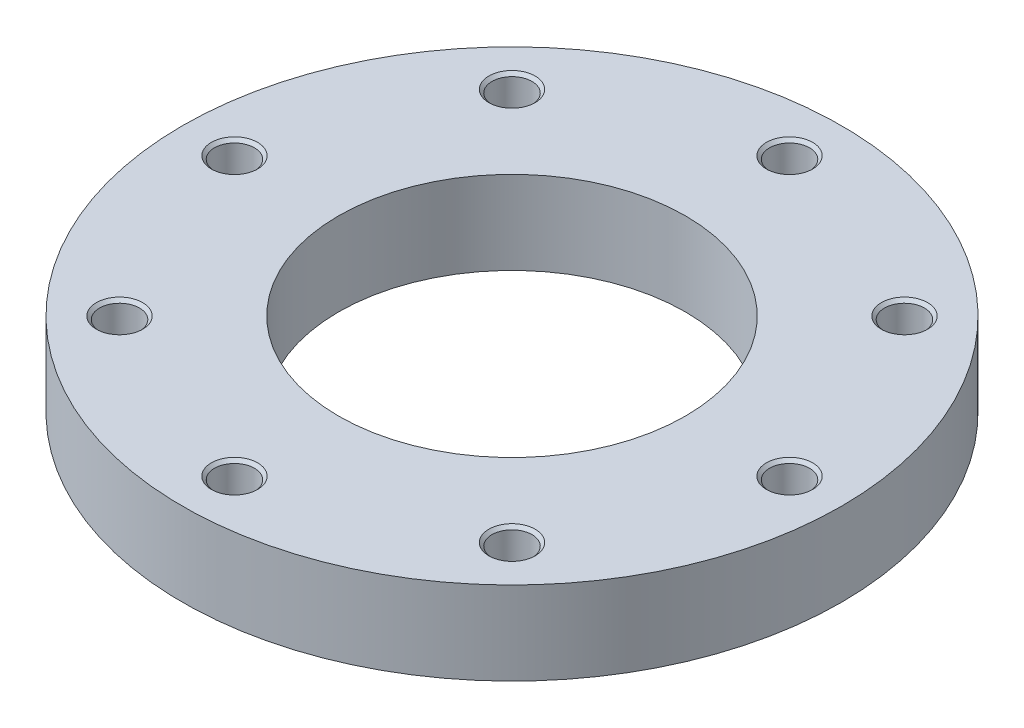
ISO-10303-21;
HEADER;
FILE_DESCRIPTION(('STEP AP214'),'2;1');
FILE_NAME('part.step','',(''),(''),'','','');
FILE_SCHEMA(('AUTOMOTIVE_DESIGN { 1 0 10303 214 1 1 1 1 }'));
ENDSEC;
DATA;
#1=APPLICATION_CONTEXT('core data for automotive mechanical design processes');
#2=APPLICATION_PROTOCOL_DEFINITION('international standard','automotive_design',2000,#1);
#3=PRODUCT_CONTEXT('',#1,'mechanical');
#4=PRODUCT('Part','Part','',(#3));
#5=PRODUCT_RELATED_PRODUCT_CATEGORY('part','',(#4));
#6=PRODUCT_DEFINITION_FORMATION('','',#4);
#7=PRODUCT_DEFINITION_CONTEXT('part definition',#1,'design');
#8=PRODUCT_DEFINITION('design','',#6,#7);
#9=PRODUCT_DEFINITION_SHAPE('','',#8);
#10=(LENGTH_UNIT() NAMED_UNIT(*) SI_UNIT(.MILLI.,.METRE.));
#11=(NAMED_UNIT(*) PLANE_ANGLE_UNIT() SI_UNIT($,.RADIAN.));
#12=(NAMED_UNIT(*) SI_UNIT($,.STERADIAN.) SOLID_ANGLE_UNIT());
#13=UNCERTAINTY_MEASURE_WITH_UNIT(LENGTH_MEASURE(1.E-05),#10,'distance_accuracy_value','');
#14=(GEOMETRIC_REPRESENTATION_CONTEXT(3) GLOBAL_UNCERTAINTY_ASSIGNED_CONTEXT((#13)) GLOBAL_UNIT_ASSIGNED_CONTEXT((#10,
#11,#12)) REPRESENTATION_CONTEXT('',''));
#15=CARTESIAN_POINT('',(0.,0.,0.));
#16=DIRECTION('',(0.,0.,1.));
#17=DIRECTION('',(1.,0.,0.));
#18=AXIS2_PLACEMENT_3D('',#15,#16,#17);
#19=CARTESIAN_POINT('',(0.,18.,0.));
#20=DIRECTION('',(0.,-1.,0.));
#21=DIRECTION('',(1.,0.,0.));
#22=AXIS2_PLACEMENT_3D('',#19,#20,#21);
#23=CYLINDRICAL_SURFACE('',#22,142.5);
#24=CARTESIAN_POINT('',(0.,0.,0.));
#25=DIRECTION('',(0.,1.,0.));
#26=DIRECTION('',(1.,0.,0.));
#27=AXIS2_PLACEMENT_3D('',#24,#25,#26);
#28=CIRCLE('',#27,142.5);
#29=CARTESIAN_POINT('',(142.5,0.,0.));
#30=VERTEX_POINT('',#29);
#31=EDGE_CURVE('E9',#30,#30,#28,.T.);
#32=ORIENTED_EDGE('',*,*,#31,.T.);
#33=EDGE_LOOP('',(#32));
#34=FACE_BOUND('',#33,.T.);
#35=CARTESIAN_POINT('',(0.,36.,0.));
#36=DIRECTION('',(0.,1.,0.));
#37=DIRECTION('',(1.,0.,0.));
#38=AXIS2_PLACEMENT_3D('',#35,#36,#37);
#39=CIRCLE('',#38,142.5);
#40=CARTESIAN_POINT('',(142.5,36.,0.));
#41=VERTEX_POINT('',#40);
#42=EDGE_CURVE('E198',#41,#41,#39,.T.);
#43=ORIENTED_EDGE('',*,*,#42,.F.);
#44=EDGE_LOOP('',(#43));
#45=FACE_BOUND('',#44,.T.);
#46=ADVANCED_FACE('F15',(#34,#45),#23,.T.);
#47=CARTESIAN_POINT('',(108.75,0.,0.));
#48=DIRECTION('',(0.,-1.,0.));
#49=DIRECTION('',(-1.,0.,0.));
#50=AXIS2_PLACEMENT_3D('',#47,#48,#49);
#51=PLANE('',#50);
#52=CARTESIAN_POINT('',(0.,0.,0.));
#53=DIRECTION('',(0.,1.,0.));
#54=DIRECTION('',(1.,0.,0.));
#55=AXIS2_PLACEMENT_3D('',#52,#53,#54);
#56=CIRCLE('',#55,75.);
#57=CARTESIAN_POINT('',(75.,0.,0.));
#58=VERTEX_POINT('',#57);
#59=EDGE_CURVE('E18',#58,#58,#56,.T.);
#60=ORIENTED_EDGE('',*,*,#59,.T.);
#61=EDGE_LOOP('',(#60));
#62=FACE_BOUND('',#61,.T.);
#63=ORIENTED_EDGE('',*,*,#31,.F.);
#64=EDGE_LOOP('',(#63));
#65=FACE_BOUND('',#64,.T.);
#66=ADVANCED_FACE('F353',(#62,#65),#51,.T.);
#67=CARTESIAN_POINT('',(0.,18.,0.));
#68=DIRECTION('',(0.,-1.,0.));
#69=DIRECTION('',(1.,0.,0.));
#70=AXIS2_PLACEMENT_3D('',#67,#68,#69);
#71=CYLINDRICAL_SURFACE('',#70,75.);
#72=CARTESIAN_POINT('',(0.,36.,0.));
#73=DIRECTION('',(0.,1.,0.));
#74=DIRECTION('',(1.,0.,0.));
#75=AXIS2_PLACEMENT_3D('',#72,#73,#74);
#76=CIRCLE('',#75,75.);
#77=CARTESIAN_POINT('',(75.,36.,0.));
#78=VERTEX_POINT('',#77);
#79=EDGE_CURVE('E194',#78,#78,#76,.T.);
#80=ORIENTED_EDGE('',*,*,#79,.T.);
#81=EDGE_LOOP('',(#80));
#82=FACE_BOUND('',#81,.T.);
#83=ORIENTED_EDGE('',*,*,#59,.F.);
#84=EDGE_LOOP('',(#83));
#85=FACE_BOUND('',#84,.T.);
#86=ADVANCED_FACE('F195',(#82,#85),#71,.F.);
#87=CARTESIAN_POINT('',(108.75,36.,0.));
#88=DIRECTION('',(0.,1.,0.));
#89=DIRECTION('',(1.,0.,0.));
#90=AXIS2_PLACEMENT_3D('',#87,#88,#89);
#91=PLANE('',#90);
#92=ORIENTED_EDGE('',*,*,#42,.T.);
#93=EDGE_LOOP('',(#92));
#94=FACE_BOUND('',#93,.T.);
#95=ORIENTED_EDGE('',*,*,#79,.F.);
#96=EDGE_LOOP('',(#95));
#97=FACE_BOUND('',#96,.T.);
#98=CARTESIAN_POINT('',(120.,36.,0.));
#99=DIRECTION('',(0.,-1.,0.));
#100=DIRECTION('',(1.,0.,0.));
#101=AXIS2_PLACEMENT_3D('',#98,#99,#100);
#102=CIRCLE('',#101,10.);
#103=CARTESIAN_POINT('',(130.,36.,0.));
#104=VERTEX_POINT('',#103);
#105=EDGE_CURVE('E208',#104,#104,#102,.T.);
#106=ORIENTED_EDGE('',*,*,#105,.T.);
#107=EDGE_LOOP('',(#106));
#108=FACE_BOUND('',#107,.T.);
#109=CARTESIAN_POINT('',(84.8528137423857,36.,-84.8528137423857));
#110=DIRECTION('',(0.,-1.,0.));
#111=DIRECTION('',(0.707106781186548,0.,-0.707106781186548));
#112=AXIS2_PLACEMENT_3D('',#109,#110,#111);
#113=CIRCLE('',#112,10.);
#114=CARTESIAN_POINT('',(91.9238815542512,36.,-91.9238815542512));
#115=VERTEX_POINT('',#114);
#116=EDGE_CURVE('E220',#115,#115,#113,.T.);
#117=ORIENTED_EDGE('',*,*,#116,.T.);
#118=EDGE_LOOP('',(#117));
#119=FACE_BOUND('',#118,.T.);
#120=CARTESIAN_POINT('',(0.,36.,-120.));
#121=DIRECTION('',(0.,-1.,0.));
#122=DIRECTION('',(0.,0.,-1.));
#123=AXIS2_PLACEMENT_3D('',#120,#121,#122);
#124=CIRCLE('',#123,10.);
#125=CARTESIAN_POINT('',(0.,36.,-130.));
#126=VERTEX_POINT('',#125);
#127=EDGE_CURVE('E232',#126,#126,#124,.T.);
#128=ORIENTED_EDGE('',*,*,#127,.T.);
#129=EDGE_LOOP('',(#128));
#130=FACE_BOUND('',#129,.T.);
#131=CARTESIAN_POINT('',(-84.8528137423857,36.,-84.8528137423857));
#132=DIRECTION('',(0.,-1.,0.));
#133=DIRECTION('',(-0.707106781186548,0.,-0.707106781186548));
#134=AXIS2_PLACEMENT_3D('',#131,#132,#133);
#135=CIRCLE('',#134,10.);
#136=CARTESIAN_POINT('',(-91.9238815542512,36.,-91.9238815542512));
#137=VERTEX_POINT('',#136);
#138=EDGE_CURVE('E244',#137,#137,#135,.T.);
#139=ORIENTED_EDGE('',*,*,#138,.T.);
#140=EDGE_LOOP('',(#139));
#141=FACE_BOUND('',#140,.T.);
#142=CARTESIAN_POINT('',(-120.,36.,0.));
#143=DIRECTION('',(0.,-1.,0.));
#144=DIRECTION('',(-1.,0.,0.));
#145=AXIS2_PLACEMENT_3D('',#142,#143,#144);
#146=CIRCLE('',#145,10.);
#147=CARTESIAN_POINT('',(-130.,36.,0.));
#148=VERTEX_POINT('',#147);
#149=EDGE_CURVE('E256',#148,#148,#146,.T.);
#150=ORIENTED_EDGE('',*,*,#149,.T.);
#151=EDGE_LOOP('',(#150));
#152=FACE_BOUND('',#151,.T.);
#153=CARTESIAN_POINT('',(-84.8528137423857,36.,84.8528137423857));
#154=DIRECTION('',(0.,-1.,0.));
#155=DIRECTION('',(-0.707106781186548,0.,0.707106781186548));
#156=AXIS2_PLACEMENT_3D('',#153,#154,#155);
#157=CIRCLE('',#156,10.);
#158=CARTESIAN_POINT('',(-91.9238815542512,36.,91.9238815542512));
#159=VERTEX_POINT('',#158);
#160=EDGE_CURVE('E269',#159,#159,#157,.T.);
#161=ORIENTED_EDGE('',*,*,#160,.T.);
#162=EDGE_LOOP('',(#161));
#163=FACE_BOUND('',#162,.T.);
#164=CARTESIAN_POINT('',(0.,36.,120.));
#165=DIRECTION('',(0.,-1.,0.));
#166=DIRECTION('',(0.,0.,1.));
#167=AXIS2_PLACEMENT_3D('',#164,#165,#166);
#168=CIRCLE('',#167,10.);
#169=CARTESIAN_POINT('',(0.,36.,130.));
#170=VERTEX_POINT('',#169);
#171=EDGE_CURVE('E283',#170,#170,#168,.T.);
#172=ORIENTED_EDGE('',*,*,#171,.T.);
#173=EDGE_LOOP('',(#172));
#174=FACE_BOUND('',#173,.T.);
#175=CARTESIAN_POINT('',(84.8528137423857,36.,84.8528137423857));
#176=DIRECTION('',(0.,-1.,0.));
#177=DIRECTION('',(0.707106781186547,0.,0.707106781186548));
#178=AXIS2_PLACEMENT_3D('',#175,#176,#177);
#179=CIRCLE('',#178,10.);
#180=CARTESIAN_POINT('',(91.9238815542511,36.,91.9238815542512));
#181=VERTEX_POINT('',#180);
#182=EDGE_CURVE('E292',#181,#181,#179,.T.);
#183=ORIENTED_EDGE('',*,*,#182,.T.);
#184=EDGE_LOOP('',(#183));
#185=FACE_BOUND('',#184,.T.);
#186=ADVANCED_FACE('F305',(#94,#97,#108,#119,#130,#141,#152,#163,#174,#185),#91,.T.);
#187=CARTESIAN_POINT('',(120.,5.50386219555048,0.));
#188=DIRECTION('',(0.,1.,0.));
#189=DIRECTION('',(1.,0.,0.));
#190=AXIS2_PLACEMENT_3D('',#187,#188,#189);
#191=CONICAL_SURFACE('',#190,4.3234375,1.0471975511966);
#192=CARTESIAN_POINT('',(120.,8.,0.));
#193=DIRECTION('',(0.,-1.,0.));
#194=DIRECTION('',(1.,0.,0.));
#195=AXIS2_PLACEMENT_3D('',#192,#193,#194);
#196=CIRCLE('',#195,8.646875);
#197=CARTESIAN_POINT('',(128.646875,8.,0.));
#198=VERTEX_POINT('',#197);
#199=EDGE_CURVE('E199',#198,#198,#196,.T.);
#200=ORIENTED_EDGE('',*,*,#199,.F.);
#201=EDGE_LOOP('',(#200));
#202=FACE_BOUND('',#201,.T.);
#203=CARTESIAN_POINT('',(120.,3.00772439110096,0.));
#204=VERTEX_POINT('',#203);
#205=VERTEX_LOOP('',#204);
#206=FACE_BOUND('',#205,.T.);
#207=ADVANCED_FACE('F361',(#202,#206),#191,.F.);
#208=CARTESIAN_POINT('',(120.,11.3234375,0.));
#209=DIRECTION('',(0.,1.,0.));
#210=DIRECTION('',(1.,0.,0.));
#211=AXIS2_PLACEMENT_3D('',#208,#209,#210);
#212=CYLINDRICAL_SURFACE('',#211,8.646875);
#213=CARTESIAN_POINT('',(120.,14.646875,0.));
#214=DIRECTION('',(0.,-1.,0.));
#215=DIRECTION('',(1.,0.,0.));
#216=AXIS2_PLACEMENT_3D('',#213,#214,#215);
#217=CIRCLE('',#216,8.646875);
#218=CARTESIAN_POINT('',(128.646875,14.646875,0.));
#219=VERTEX_POINT('',#218);
#220=EDGE_CURVE('E201',#219,#219,#217,.T.);
#221=ORIENTED_EDGE('',*,*,#220,.F.);
#222=EDGE_LOOP('',(#221));
#223=FACE_BOUND('',#222,.T.);
#224=ORIENTED_EDGE('',*,*,#199,.T.);
#225=EDGE_LOOP('',(#224));
#226=FACE_BOUND('',#225,.T.);
#227=ADVANCED_FACE('F520',(#223,#226),#212,.F.);
#228=CARTESIAN_POINT('',(120.,15.3234375,0.));
#229=DIRECTION('',(0.,1.,0.));
#230=DIRECTION('',(1.,0.,0.));
#231=AXIS2_PLACEMENT_3D('',#228,#229,#230);
#232=CONICAL_SURFACE('',#231,9.3234375,0.785398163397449);
#233=CARTESIAN_POINT('',(120.,16.,0.));
#234=DIRECTION('',(0.,-1.,0.));
#235=DIRECTION('',(1.,0.,0.));
#236=AXIS2_PLACEMENT_3D('',#233,#234,#235);
#237=CIRCLE('',#236,10.);
#238=CARTESIAN_POINT('',(130.,16.,0.));
#239=VERTEX_POINT('',#238);
#240=EDGE_CURVE('E205',#239,#239,#237,.T.);
#241=ORIENTED_EDGE('',*,*,#240,.F.);
#242=EDGE_LOOP('',(#241));
#243=FACE_BOUND('',#242,.T.);
#244=ORIENTED_EDGE('',*,*,#220,.T.);
#245=EDGE_LOOP('',(#244));
#246=FACE_BOUND('',#245,.T.);
#247=ADVANCED_FACE('F516',(#243,#246),#232,.F.);
#248=CARTESIAN_POINT('',(129.3234375,16.,0.));
#249=DIRECTION('',(0.,1.,0.));
#250=DIRECTION('',(-1.,0.,0.));
#251=AXIS2_PLACEMENT_3D('',#248,#249,#250);
#252=PLANE('',#251);
#253=CARTESIAN_POINT('',(120.,16.,0.));
#254=DIRECTION('',(0.,-1.,0.));
#255=DIRECTION('',(1.,0.,0.));
#256=AXIS2_PLACEMENT_3D('',#253,#254,#255);
#257=CIRCLE('',#256,8.646875);
#258=CARTESIAN_POINT('',(128.646875,16.,0.));
#259=VERTEX_POINT('',#258);
#260=EDGE_CURVE('E206',#259,#259,#257,.T.);
#261=ORIENTED_EDGE('',*,*,#260,.F.);
#262=EDGE_LOOP('',(#261));
#263=FACE_BOUND('',#262,.T.);
#264=ORIENTED_EDGE('',*,*,#240,.T.);
#265=EDGE_LOOP('',(#264));
#266=FACE_BOUND('',#265,.T.);
#267=ADVANCED_FACE('F512',(#263,#266),#252,.F.);
#268=CARTESIAN_POINT('',(120.,25.3234375,0.));
#269=DIRECTION('',(0.,1.,0.));
#270=DIRECTION('',(1.,0.,0.));
#271=AXIS2_PLACEMENT_3D('',#268,#269,#270);
#272=CYLINDRICAL_SURFACE('',#271,8.646875);
#273=CARTESIAN_POINT('',(120.,34.646875,0.));
#274=DIRECTION('',(0.,-1.,0.));
#275=DIRECTION('',(1.,0.,0.));
#276=AXIS2_PLACEMENT_3D('',#273,#274,#275);
#277=CIRCLE('',#276,8.646875);
#278=CARTESIAN_POINT('',(128.646875,34.646875,0.));
#279=VERTEX_POINT('',#278);
#280=EDGE_CURVE('E210',#279,#279,#277,.T.);
#281=ORIENTED_EDGE('',*,*,#280,.F.);
#282=EDGE_LOOP('',(#281));
#283=FACE_BOUND('',#282,.T.);
#284=ORIENTED_EDGE('',*,*,#260,.T.);
#285=EDGE_LOOP('',(#284));
#286=FACE_BOUND('',#285,.T.);
#287=ADVANCED_FACE('F508',(#283,#286),#272,.F.);
#288=CARTESIAN_POINT('',(120.,35.3234375,0.));
#289=DIRECTION('',(0.,1.,0.));
#290=DIRECTION('',(1.,0.,0.));
#291=AXIS2_PLACEMENT_3D('',#288,#289,#290);
#292=CONICAL_SURFACE('',#291,9.3234375,0.785398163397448);
#293=ORIENTED_EDGE('',*,*,#105,.F.);
#294=EDGE_LOOP('',(#293));
#295=FACE_BOUND('',#294,.T.);
#296=ORIENTED_EDGE('',*,*,#280,.T.);
#297=EDGE_LOOP('',(#296));
#298=FACE_BOUND('',#297,.T.);
#299=ADVANCED_FACE('F504',(#295,#298),#292,.F.);
#300=CARTESIAN_POINT('',(84.8528137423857,5.50386219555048,-84.8528137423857));
#301=DIRECTION('',(0.,1.,0.));
#302=DIRECTION('',(0.707106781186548,0.,-0.707106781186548));
#303=AXIS2_PLACEMENT_3D('',#300,#301,#302);
#304=CONICAL_SURFACE('',#303,4.3234375,1.0471975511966);
#305=CARTESIAN_POINT('',(84.8528137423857,8.,-84.8528137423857));
#306=DIRECTION('',(0.,-1.,0.));
#307=DIRECTION('',(0.707106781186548,0.,-0.707106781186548));
#308=AXIS2_PLACEMENT_3D('',#305,#306,#307);
#309=CIRCLE('',#308,8.646875);
#310=CARTESIAN_POINT('',(90.9670776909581,8.,-90.9670776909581));
#311=VERTEX_POINT('',#310);
#312=EDGE_CURVE('E212',#311,#311,#309,.T.);
#313=ORIENTED_EDGE('',*,*,#312,.F.);
#314=EDGE_LOOP('',(#313));
#315=FACE_BOUND('',#314,.T.);
#316=CARTESIAN_POINT('',(84.8528137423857,3.00772439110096,-84.8528137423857));
#317=VERTEX_POINT('',#316);
#318=VERTEX_LOOP('',#317);
#319=FACE_BOUND('',#318,.T.);
#320=ADVANCED_FACE('F500',(#315,#319),#304,.F.);
#321=CARTESIAN_POINT('',(84.8528137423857,11.3234375,-84.8528137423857));
#322=DIRECTION('',(0.,1.,0.));
#323=DIRECTION('',(0.707106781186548,0.,-0.707106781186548));
#324=AXIS2_PLACEMENT_3D('',#321,#322,#323);
#325=CYLINDRICAL_SURFACE('',#324,8.646875);
#326=CARTESIAN_POINT('',(84.8528137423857,14.646875,-84.8528137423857));
#327=DIRECTION('',(0.,-1.,0.));
#328=DIRECTION('',(0.707106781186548,0.,-0.707106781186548));
#329=AXIS2_PLACEMENT_3D('',#326,#327,#328);
#330=CIRCLE('',#329,8.646875);
#331=CARTESIAN_POINT('',(90.9670776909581,14.646875,-90.9670776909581));
#332=VERTEX_POINT('',#331);
#333=EDGE_CURVE('E214',#332,#332,#330,.T.);
#334=ORIENTED_EDGE('',*,*,#333,.F.);
#335=EDGE_LOOP('',(#334));
#336=FACE_BOUND('',#335,.T.);
#337=ORIENTED_EDGE('',*,*,#312,.T.);
#338=EDGE_LOOP('',(#337));
#339=FACE_BOUND('',#338,.T.);
#340=ADVANCED_FACE('F496',(#336,#339),#325,.F.);
#341=CARTESIAN_POINT('',(84.8528137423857,15.3234375,-84.8528137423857));
#342=DIRECTION('',(0.,1.,0.));
#343=DIRECTION('',(0.707106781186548,0.,-0.707106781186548));
#344=AXIS2_PLACEMENT_3D('',#341,#342,#343);
#345=CONICAL_SURFACE('',#344,9.3234375,0.785398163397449);
#346=CARTESIAN_POINT('',(84.8528137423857,16.,-84.8528137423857));
#347=DIRECTION('',(0.,-1.,0.));
#348=DIRECTION('',(0.707106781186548,0.,-0.707106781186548));
#349=AXIS2_PLACEMENT_3D('',#346,#347,#348);
#350=CIRCLE('',#349,10.);
#351=CARTESIAN_POINT('',(91.9238815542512,16.,-91.9238815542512));
#352=VERTEX_POINT('',#351);
#353=EDGE_CURVE('E216',#352,#352,#350,.T.);
#354=ORIENTED_EDGE('',*,*,#353,.F.);
#355=EDGE_LOOP('',(#354));
#356=FACE_BOUND('',#355,.T.);
#357=ORIENTED_EDGE('',*,*,#333,.T.);
#358=EDGE_LOOP('',(#357));
#359=FACE_BOUND('',#358,.T.);
#360=ADVANCED_FACE('F492',(#356,#359),#345,.F.);
#361=CARTESIAN_POINT('',(91.4454796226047,16.,-91.4454796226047));
#362=DIRECTION('',(0.,1.,0.));
#363=DIRECTION('',(-0.707106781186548,0.,0.707106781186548));
#364=AXIS2_PLACEMENT_3D('',#361,#362,#363);
#365=PLANE('',#364);
#366=CARTESIAN_POINT('',(84.8528137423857,16.,-84.8528137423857));
#367=DIRECTION('',(0.,-1.,0.));
#368=DIRECTION('',(0.707106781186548,0.,-0.707106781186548));
#369=AXIS2_PLACEMENT_3D('',#366,#367,#368);
#370=CIRCLE('',#369,8.646875);
#371=CARTESIAN_POINT('',(90.9670776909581,16.,-90.9670776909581));
#372=VERTEX_POINT('',#371);
#373=EDGE_CURVE('E218',#372,#372,#370,.T.);
#374=ORIENTED_EDGE('',*,*,#373,.F.);
#375=EDGE_LOOP('',(#374));
#376=FACE_BOUND('',#375,.T.);
#377=ORIENTED_EDGE('',*,*,#353,.T.);
#378=EDGE_LOOP('',(#377));
#379=FACE_BOUND('',#378,.T.);
#380=ADVANCED_FACE('F488',(#376,#379),#365,.F.);
#381=CARTESIAN_POINT('',(84.8528137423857,25.3234375,-84.8528137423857));
#382=DIRECTION('',(0.,1.,0.));
#383=DIRECTION('',(0.707106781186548,0.,-0.707106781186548));
#384=AXIS2_PLACEMENT_3D('',#381,#382,#383);
#385=CYLINDRICAL_SURFACE('',#384,8.646875);
#386=CARTESIAN_POINT('',(84.8528137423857,34.646875,-84.8528137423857));
#387=DIRECTION('',(0.,-1.,0.));
#388=DIRECTION('',(0.707106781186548,0.,-0.707106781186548));
#389=AXIS2_PLACEMENT_3D('',#386,#387,#388);
#390=CIRCLE('',#389,8.646875);
#391=CARTESIAN_POINT('',(90.9670776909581,34.646875,-90.9670776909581));
#392=VERTEX_POINT('',#391);
#393=EDGE_CURVE('E222',#392,#392,#390,.T.);
#394=ORIENTED_EDGE('',*,*,#393,.F.);
#395=EDGE_LOOP('',(#394));
#396=FACE_BOUND('',#395,.T.);
#397=ORIENTED_EDGE('',*,*,#373,.T.);
#398=EDGE_LOOP('',(#397));
#399=FACE_BOUND('',#398,.T.);
#400=ADVANCED_FACE('F484',(#396,#399),#385,.F.);
#401=CARTESIAN_POINT('',(84.8528137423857,35.3234375,-84.8528137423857));
#402=DIRECTION('',(0.,1.,0.));
#403=DIRECTION('',(0.707106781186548,0.,-0.707106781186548));
#404=AXIS2_PLACEMENT_3D('',#401,#402,#403);
#405=CONICAL_SURFACE('',#404,9.3234375,0.785398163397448);
#406=ORIENTED_EDGE('',*,*,#116,.F.);
#407=EDGE_LOOP('',(#406));
#408=FACE_BOUND('',#407,.T.);
#409=ORIENTED_EDGE('',*,*,#393,.T.);
#410=EDGE_LOOP('',(#409));
#411=FACE_BOUND('',#410,.T.);
#412=ADVANCED_FACE('F480',(#408,#411),#405,.F.);
#413=CARTESIAN_POINT('',(0.,5.50386219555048,-120.));
#414=DIRECTION('',(0.,1.,0.));
#415=DIRECTION('',(0.,0.,-1.));
#416=AXIS2_PLACEMENT_3D('',#413,#414,#415);
#417=CONICAL_SURFACE('',#416,4.3234375,1.0471975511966);
#418=CARTESIAN_POINT('',(0.,8.,-120.));
#419=DIRECTION('',(0.,-1.,0.));
#420=DIRECTION('',(0.,0.,-1.));
#421=AXIS2_PLACEMENT_3D('',#418,#419,#420);
#422=CIRCLE('',#421,8.646875);
#423=CARTESIAN_POINT('',(0.,8.,-128.646875));
#424=VERTEX_POINT('',#423);
#425=EDGE_CURVE('E224',#424,#424,#422,.T.);
#426=ORIENTED_EDGE('',*,*,#425,.F.);
#427=EDGE_LOOP('',(#426));
#428=FACE_BOUND('',#427,.T.);
#429=CARTESIAN_POINT('',(0.,3.00772439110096,-120.));
#430=VERTEX_POINT('',#429);
#431=VERTEX_LOOP('',#430);
#432=FACE_BOUND('',#431,.T.);
#433=ADVANCED_FACE('F476',(#428,#432),#417,.F.);
#434=CARTESIAN_POINT('',(0.,11.3234375,-120.));
#435=DIRECTION('',(0.,1.,0.));
#436=DIRECTION('',(0.,0.,-1.));
#437=AXIS2_PLACEMENT_3D('',#434,#435,#436);
#438=CYLINDRICAL_SURFACE('',#437,8.646875);
#439=CARTESIAN_POINT('',(0.,14.646875,-120.));
#440=DIRECTION('',(0.,-1.,0.));
#441=DIRECTION('',(0.,0.,-1.));
#442=AXIS2_PLACEMENT_3D('',#439,#440,#441);
#443=CIRCLE('',#442,8.646875);
#444=CARTESIAN_POINT('',(0.,14.646875,-128.646875));
#445=VERTEX_POINT('',#444);
#446=EDGE_CURVE('E226',#445,#445,#443,.T.);
#447=ORIENTED_EDGE('',*,*,#446,.F.);
#448=EDGE_LOOP('',(#447));
#449=FACE_BOUND('',#448,.T.);
#450=ORIENTED_EDGE('',*,*,#425,.T.);
#451=EDGE_LOOP('',(#450));
#452=FACE_BOUND('',#451,.T.);
#453=ADVANCED_FACE('F472',(#449,#452),#438,.F.);
#454=CARTESIAN_POINT('',(0.,15.3234375,-120.));
#455=DIRECTION('',(0.,1.,0.));
#456=DIRECTION('',(0.,0.,-1.));
#457=AXIS2_PLACEMENT_3D('',#454,#455,#456);
#458=CONICAL_SURFACE('',#457,9.3234375,0.785398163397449);
#459=CARTESIAN_POINT('',(0.,16.,-120.));
#460=DIRECTION('',(0.,-1.,0.));
#461=DIRECTION('',(0.,0.,-1.));
#462=AXIS2_PLACEMENT_3D('',#459,#460,#461);
#463=CIRCLE('',#462,10.);
#464=CARTESIAN_POINT('',(0.,16.,-130.));
#465=VERTEX_POINT('',#464);
#466=EDGE_CURVE('E228',#465,#465,#463,.T.);
#467=ORIENTED_EDGE('',*,*,#466,.F.);
#468=EDGE_LOOP('',(#467));
#469=FACE_BOUND('',#468,.T.);
#470=ORIENTED_EDGE('',*,*,#446,.T.);
#471=EDGE_LOOP('',(#470));
#472=FACE_BOUND('',#471,.T.);
#473=ADVANCED_FACE('F468',(#469,#472),#458,.F.);
#474=CARTESIAN_POINT('',(0.,16.,-129.3234375));
#475=DIRECTION('',(0.,1.,0.));
#476=DIRECTION('',(0.,0.,1.));
#477=AXIS2_PLACEMENT_3D('',#474,#475,#476);
#478=PLANE('',#477);
#479=CARTESIAN_POINT('',(0.,16.,-120.));
#480=DIRECTION('',(0.,-1.,0.));
#481=DIRECTION('',(0.,0.,-1.));
#482=AXIS2_PLACEMENT_3D('',#479,#480,#481);
#483=CIRCLE('',#482,8.646875);
#484=CARTESIAN_POINT('',(0.,16.,-128.646875));
#485=VERTEX_POINT('',#484);
#486=EDGE_CURVE('E230',#485,#485,#483,.T.);
#487=ORIENTED_EDGE('',*,*,#486,.F.);
#488=EDGE_LOOP('',(#487));
#489=FACE_BOUND('',#488,.T.);
#490=ORIENTED_EDGE('',*,*,#466,.T.);
#491=EDGE_LOOP('',(#490));
#492=FACE_BOUND('',#491,.T.);
#493=ADVANCED_FACE('F464',(#489,#492),#478,.F.);
#494=CARTESIAN_POINT('',(0.,25.3234375,-120.));
#495=DIRECTION('',(0.,1.,0.));
#496=DIRECTION('',(0.,0.,-1.));
#497=AXIS2_PLACEMENT_3D('',#494,#495,#496);
#498=CYLINDRICAL_SURFACE('',#497,8.646875);
#499=CARTESIAN_POINT('',(0.,34.646875,-120.));
#500=DIRECTION('',(0.,-1.,0.));
#501=DIRECTION('',(0.,0.,-1.));
#502=AXIS2_PLACEMENT_3D('',#499,#500,#501);
#503=CIRCLE('',#502,8.646875);
#504=CARTESIAN_POINT('',(0.,34.646875,-128.646875));
#505=VERTEX_POINT('',#504);
#506=EDGE_CURVE('E234',#505,#505,#503,.T.);
#507=ORIENTED_EDGE('',*,*,#506,.F.);
#508=EDGE_LOOP('',(#507));
#509=FACE_BOUND('',#508,.T.);
#510=ORIENTED_EDGE('',*,*,#486,.T.);
#511=EDGE_LOOP('',(#510));
#512=FACE_BOUND('',#511,.T.);
#513=ADVANCED_FACE('F460',(#509,#512),#498,.F.);
#514=CARTESIAN_POINT('',(0.,35.3234375,-120.));
#515=DIRECTION('',(0.,1.,0.));
#516=DIRECTION('',(0.,0.,-1.));
#517=AXIS2_PLACEMENT_3D('',#514,#515,#516);
#518=CONICAL_SURFACE('',#517,9.3234375,0.785398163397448);
#519=ORIENTED_EDGE('',*,*,#127,.F.);
#520=EDGE_LOOP('',(#519));
#521=FACE_BOUND('',#520,.T.);
#522=ORIENTED_EDGE('',*,*,#506,.T.);
#523=EDGE_LOOP('',(#522));
#524=FACE_BOUND('',#523,.T.);
#525=ADVANCED_FACE('F456',(#521,#524),#518,.F.);
#526=CARTESIAN_POINT('',(-84.8528137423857,5.50386219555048,-84.8528137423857));
#527=DIRECTION('',(0.,1.,0.));
#528=DIRECTION('',(-0.707106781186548,0.,-0.707106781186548));
#529=AXIS2_PLACEMENT_3D('',#526,#527,#528);
#530=CONICAL_SURFACE('',#529,4.3234375,1.0471975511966);
#531=CARTESIAN_POINT('',(-84.8528137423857,8.,-84.8528137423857));
#532=DIRECTION('',(0.,-1.,0.));
#533=DIRECTION('',(-0.707106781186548,0.,-0.707106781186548));
#534=AXIS2_PLACEMENT_3D('',#531,#532,#533);
#535=CIRCLE('',#534,8.646875);
#536=CARTESIAN_POINT('',(-90.9670776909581,8.,-90.9670776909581));
#537=VERTEX_POINT('',#536);
#538=EDGE_CURVE('E236',#537,#537,#535,.T.);
#539=ORIENTED_EDGE('',*,*,#538,.F.);
#540=EDGE_LOOP('',(#539));
#541=FACE_BOUND('',#540,.T.);
#542=CARTESIAN_POINT('',(-84.8528137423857,3.00772439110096,-84.8528137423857));
#543=VERTEX_POINT('',#542);
#544=VERTEX_LOOP('',#543);
#545=FACE_BOUND('',#544,.T.);
#546=ADVANCED_FACE('F452',(#541,#545),#530,.F.);
#547=CARTESIAN_POINT('',(-84.8528137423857,11.3234375,-84.8528137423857));
#548=DIRECTION('',(0.,1.,0.));
#549=DIRECTION('',(-0.707106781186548,0.,-0.707106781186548));
#550=AXIS2_PLACEMENT_3D('',#547,#548,#549);
#551=CYLINDRICAL_SURFACE('',#550,8.646875);
#552=CARTESIAN_POINT('',(-84.8528137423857,14.646875,-84.8528137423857));
#553=DIRECTION('',(0.,-1.,0.));
#554=DIRECTION('',(-0.707106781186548,0.,-0.707106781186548));
#555=AXIS2_PLACEMENT_3D('',#552,#553,#554);
#556=CIRCLE('',#555,8.646875);
#557=CARTESIAN_POINT('',(-90.9670776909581,14.646875,-90.9670776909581));
#558=VERTEX_POINT('',#557);
#559=EDGE_CURVE('E238',#558,#558,#556,.T.);
#560=ORIENTED_EDGE('',*,*,#559,.F.);
#561=EDGE_LOOP('',(#560));
#562=FACE_BOUND('',#561,.T.);
#563=ORIENTED_EDGE('',*,*,#538,.T.);
#564=EDGE_LOOP('',(#563));
#565=FACE_BOUND('',#564,.T.);
#566=ADVANCED_FACE('F448',(#562,#565),#551,.F.);
#567=CARTESIAN_POINT('',(-84.8528137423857,15.3234375,-84.8528137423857));
#568=DIRECTION('',(0.,1.,0.));
#569=DIRECTION('',(-0.707106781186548,0.,-0.707106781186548));
#570=AXIS2_PLACEMENT_3D('',#567,#568,#569);
#571=CONICAL_SURFACE('',#570,9.3234375,0.785398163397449);
#572=CARTESIAN_POINT('',(-84.8528137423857,16.,-84.8528137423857));
#573=DIRECTION('',(0.,-1.,0.));
#574=DIRECTION('',(-0.707106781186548,0.,-0.707106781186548));
#575=AXIS2_PLACEMENT_3D('',#572,#573,#574);
#576=CIRCLE('',#575,10.);
#577=CARTESIAN_POINT('',(-91.9238815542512,16.,-91.9238815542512));
#578=VERTEX_POINT('',#577);
#579=EDGE_CURVE('E240',#578,#578,#576,.T.);
#580=ORIENTED_EDGE('',*,*,#579,.F.);
#581=EDGE_LOOP('',(#580));
#582=FACE_BOUND('',#581,.T.);
#583=ORIENTED_EDGE('',*,*,#559,.T.);
#584=EDGE_LOOP('',(#583));
#585=FACE_BOUND('',#584,.T.);
#586=ADVANCED_FACE('F444',(#582,#585),#571,.F.);
#587=CARTESIAN_POINT('',(-91.4454796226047,16.,-91.4454796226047));
#588=DIRECTION('',(0.,1.,0.));
#589=DIRECTION('',(0.707106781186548,0.,0.707106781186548));
#590=AXIS2_PLACEMENT_3D('',#587,#588,#589);
#591=PLANE('',#590);
#592=CARTESIAN_POINT('',(-84.8528137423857,16.,-84.8528137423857));
#593=DIRECTION('',(0.,-1.,0.));
#594=DIRECTION('',(-0.707106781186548,0.,-0.707106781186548));
#595=AXIS2_PLACEMENT_3D('',#592,#593,#594);
#596=CIRCLE('',#595,8.646875);
#597=CARTESIAN_POINT('',(-90.9670776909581,16.,-90.9670776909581));
#598=VERTEX_POINT('',#597);
#599=EDGE_CURVE('E242',#598,#598,#596,.T.);
#600=ORIENTED_EDGE('',*,*,#599,.F.);
#601=EDGE_LOOP('',(#600));
#602=FACE_BOUND('',#601,.T.);
#603=ORIENTED_EDGE('',*,*,#579,.T.);
#604=EDGE_LOOP('',(#603));
#605=FACE_BOUND('',#604,.T.);
#606=ADVANCED_FACE('F440',(#602,#605),#591,.F.);
#607=CARTESIAN_POINT('',(-84.8528137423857,25.3234375,-84.8528137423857));
#608=DIRECTION('',(0.,1.,0.));
#609=DIRECTION('',(-0.707106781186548,0.,-0.707106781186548));
#610=AXIS2_PLACEMENT_3D('',#607,#608,#609);
#611=CYLINDRICAL_SURFACE('',#610,8.646875);
#612=CARTESIAN_POINT('',(-84.8528137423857,34.646875,-84.8528137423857));
#613=DIRECTION('',(0.,-1.,0.));
#614=DIRECTION('',(-0.707106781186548,0.,-0.707106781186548));
#615=AXIS2_PLACEMENT_3D('',#612,#613,#614);
#616=CIRCLE('',#615,8.646875);
#617=CARTESIAN_POINT('',(-90.9670776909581,34.646875,-90.9670776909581));
#618=VERTEX_POINT('',#617);
#619=EDGE_CURVE('E247',#618,#618,#616,.T.);
#620=ORIENTED_EDGE('',*,*,#619,.F.);
#621=EDGE_LOOP('',(#620));
#622=FACE_BOUND('',#621,.T.);
#623=ORIENTED_EDGE('',*,*,#599,.T.);
#624=EDGE_LOOP('',(#623));
#625=FACE_BOUND('',#624,.T.);
#626=ADVANCED_FACE('F436',(#622,#625),#611,.F.);
#627=CARTESIAN_POINT('',(-84.8528137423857,35.3234375,-84.8528137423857));
#628=DIRECTION('',(0.,1.,0.));
#629=DIRECTION('',(-0.707106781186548,0.,-0.707106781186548));
#630=AXIS2_PLACEMENT_3D('',#627,#628,#629);
#631=CONICAL_SURFACE('',#630,9.3234375,0.785398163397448);
#632=ORIENTED_EDGE('',*,*,#138,.F.);
#633=EDGE_LOOP('',(#632));
#634=FACE_BOUND('',#633,.T.);
#635=ORIENTED_EDGE('',*,*,#619,.T.);
#636=EDGE_LOOP('',(#635));
#637=FACE_BOUND('',#636,.T.);
#638=ADVANCED_FACE('F432',(#634,#637),#631,.F.);
#639=CARTESIAN_POINT('',(-120.,5.50386219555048,0.));
#640=DIRECTION('',(0.,1.,0.));
#641=DIRECTION('',(-1.,0.,0.));
#642=AXIS2_PLACEMENT_3D('',#639,#640,#641);
#643=CONICAL_SURFACE('',#642,4.3234375,1.0471975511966);
#644=CARTESIAN_POINT('',(-120.,8.,0.));
#645=DIRECTION('',(0.,-1.,0.));
#646=DIRECTION('',(-1.,0.,0.));
#647=AXIS2_PLACEMENT_3D('',#644,#645,#646);
#648=CIRCLE('',#647,8.646875);
#649=CARTESIAN_POINT('',(-128.646875,8.,0.));
#650=VERTEX_POINT('',#649);
#651=EDGE_CURVE('E249',#650,#650,#648,.T.);
#652=ORIENTED_EDGE('',*,*,#651,.F.);
#653=EDGE_LOOP('',(#652));
#654=FACE_BOUND('',#653,.T.);
#655=CARTESIAN_POINT('',(-120.,3.00772439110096,0.));
#656=VERTEX_POINT('',#655);
#657=VERTEX_LOOP('',#656);
#658=FACE_BOUND('',#657,.T.);
#659=ADVANCED_FACE('F428',(#654,#658),#643,.F.);
#660=CARTESIAN_POINT('',(-120.,11.3234375,0.));
#661=DIRECTION('',(0.,1.,0.));
#662=DIRECTION('',(-1.,0.,0.));
#663=AXIS2_PLACEMENT_3D('',#660,#661,#662);
#664=CYLINDRICAL_SURFACE('',#663,8.646875);
#665=CARTESIAN_POINT('',(-120.,14.646875,0.));
#666=DIRECTION('',(0.,-1.,0.));
#667=DIRECTION('',(-1.,0.,0.));
#668=AXIS2_PLACEMENT_3D('',#665,#666,#667);
#669=CIRCLE('',#668,8.646875);
#670=CARTESIAN_POINT('',(-128.646875,14.646875,0.));
#671=VERTEX_POINT('',#670);
#672=EDGE_CURVE('E253',#671,#671,#669,.T.);
#673=ORIENTED_EDGE('',*,*,#672,.F.);
#674=EDGE_LOOP('',(#673));
#675=FACE_BOUND('',#674,.T.);
#676=ORIENTED_EDGE('',*,*,#651,.T.);
#677=EDGE_LOOP('',(#676));
#678=FACE_BOUND('',#677,.T.);
#679=ADVANCED_FACE('F424',(#675,#678),#664,.F.);
#680=CARTESIAN_POINT('',(-120.,15.3234375,0.));
#681=DIRECTION('',(0.,1.,0.));
#682=DIRECTION('',(-1.,0.,0.));
#683=AXIS2_PLACEMENT_3D('',#680,#681,#682);
#684=CONICAL_SURFACE('',#683,9.3234375,0.785398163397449);
#685=CARTESIAN_POINT('',(-120.,16.,0.));
#686=DIRECTION('',(0.,-1.,0.));
#687=DIRECTION('',(-1.,0.,0.));
#688=AXIS2_PLACEMENT_3D('',#685,#686,#687);
#689=CIRCLE('',#688,10.);
#690=CARTESIAN_POINT('',(-130.,16.,0.));
#691=VERTEX_POINT('',#690);
#692=EDGE_CURVE('E255',#691,#691,#689,.T.);
#693=ORIENTED_EDGE('',*,*,#692,.F.);
#694=EDGE_LOOP('',(#693));
#695=FACE_BOUND('',#694,.T.);
#696=ORIENTED_EDGE('',*,*,#672,.T.);
#697=EDGE_LOOP('',(#696));
#698=FACE_BOUND('',#697,.T.);
#699=ADVANCED_FACE('F420',(#695,#698),#684,.F.);
#700=CARTESIAN_POINT('',(-129.3234375,16.,0.));
#701=DIRECTION('',(0.,1.,0.));
#702=DIRECTION('',(1.,0.,0.));
#703=AXIS2_PLACEMENT_3D('',#700,#701,#702);
#704=PLANE('',#703);
#705=CARTESIAN_POINT('',(-120.,16.,0.));
#706=DIRECTION('',(0.,-1.,0.));
#707=DIRECTION('',(-1.,0.,0.));
#708=AXIS2_PLACEMENT_3D('',#705,#706,#707);
#709=CIRCLE('',#708,8.646875);
#710=CARTESIAN_POINT('',(-128.646875,16.,0.));
#711=VERTEX_POINT('',#710);
#712=EDGE_CURVE('E258',#711,#711,#709,.T.);
#713=ORIENTED_EDGE('',*,*,#712,.F.);
#714=EDGE_LOOP('',(#713));
#715=FACE_BOUND('',#714,.T.);
#716=ORIENTED_EDGE('',*,*,#692,.T.);
#717=EDGE_LOOP('',(#716));
#718=FACE_BOUND('',#717,.T.);
#719=ADVANCED_FACE('F416',(#715,#718),#704,.F.);
#720=CARTESIAN_POINT('',(-120.,25.3234375,0.));
#721=DIRECTION('',(0.,1.,0.));
#722=DIRECTION('',(-1.,0.,0.));
#723=AXIS2_PLACEMENT_3D('',#720,#721,#722);
#724=CYLINDRICAL_SURFACE('',#723,8.646875);
#725=CARTESIAN_POINT('',(-120.,34.646875,0.));
#726=DIRECTION('',(0.,-1.,0.));
#727=DIRECTION('',(-1.,0.,0.));
#728=AXIS2_PLACEMENT_3D('',#725,#726,#727);
#729=CIRCLE('',#728,8.646875);
#730=CARTESIAN_POINT('',(-128.646875,34.646875,0.));
#731=VERTEX_POINT('',#730);
#732=EDGE_CURVE('E259',#731,#731,#729,.T.);
#733=ORIENTED_EDGE('',*,*,#732,.F.);
#734=EDGE_LOOP('',(#733));
#735=FACE_BOUND('',#734,.T.);
#736=ORIENTED_EDGE('',*,*,#712,.T.);
#737=EDGE_LOOP('',(#736));
#738=FACE_BOUND('',#737,.T.);
#739=ADVANCED_FACE('F409',(#735,#738),#724,.F.);
#740=CARTESIAN_POINT('',(-120.,35.3234375,0.));
#741=DIRECTION('',(0.,1.,0.));
#742=DIRECTION('',(-1.,0.,0.));
#743=AXIS2_PLACEMENT_3D('',#740,#741,#742);
#744=CONICAL_SURFACE('',#743,9.3234375,0.785398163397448);
#745=ORIENTED_EDGE('',*,*,#149,.F.);
#746=EDGE_LOOP('',(#745));
#747=FACE_BOUND('',#746,.T.);
#748=ORIENTED_EDGE('',*,*,#732,.T.);
#749=EDGE_LOOP('',(#748));
#750=FACE_BOUND('',#749,.T.);
#751=ADVANCED_FACE('F404',(#747,#750),#744,.F.);
#752=CARTESIAN_POINT('',(-84.8528137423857,5.50386219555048,84.8528137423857));
#753=DIRECTION('',(0.,1.,0.));
#754=DIRECTION('',(-0.707106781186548,0.,0.707106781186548));
#755=AXIS2_PLACEMENT_3D('',#752,#753,#754);
#756=CONICAL_SURFACE('',#755,4.3234375,1.0471975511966);
#757=CARTESIAN_POINT('',(-84.8528137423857,8.,84.8528137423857));
#758=DIRECTION('',(0.,-1.,0.));
#759=DIRECTION('',(-0.707106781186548,0.,0.707106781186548));
#760=AXIS2_PLACEMENT_3D('',#757,#758,#759);
#761=CIRCLE('',#760,8.646875);
#762=CARTESIAN_POINT('',(-90.9670776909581,8.,90.9670776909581));
#763=VERTEX_POINT('',#762);
#764=EDGE_CURVE('E262',#763,#763,#761,.T.);
#765=ORIENTED_EDGE('',*,*,#764,.F.);
#766=EDGE_LOOP('',(#765));
#767=FACE_BOUND('',#766,.T.);
#768=CARTESIAN_POINT('',(-84.8528137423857,3.00772439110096,84.8528137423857));
#769=VERTEX_POINT('',#768);
#770=VERTEX_LOOP('',#769);
#771=FACE_BOUND('',#770,.T.);
#772=ADVANCED_FACE('F398',(#767,#771),#756,.F.);
#773=CARTESIAN_POINT('',(-84.8528137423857,11.3234375,84.8528137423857));
#774=DIRECTION('',(0.,1.,0.));
#775=DIRECTION('',(-0.707106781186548,0.,0.707106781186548));
#776=AXIS2_PLACEMENT_3D('',#773,#774,#775);
#777=CYLINDRICAL_SURFACE('',#776,8.646875);
#778=CARTESIAN_POINT('',(-84.8528137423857,14.646875,84.8528137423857));
#779=DIRECTION('',(0.,-1.,0.));
#780=DIRECTION('',(-0.707106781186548,0.,0.707106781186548));
#781=AXIS2_PLACEMENT_3D('',#778,#779,#780);
#782=CIRCLE('',#781,8.646875);
#783=CARTESIAN_POINT('',(-90.9670776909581,14.646875,90.9670776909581));
#784=VERTEX_POINT('',#783);
#785=EDGE_CURVE('E263',#784,#784,#782,.T.);
#786=ORIENTED_EDGE('',*,*,#785,.F.);
#787=EDGE_LOOP('',(#786));
#788=FACE_BOUND('',#787,.T.);
#789=ORIENTED_EDGE('',*,*,#764,.T.);
#790=EDGE_LOOP('',(#789));
#791=FACE_BOUND('',#790,.T.);
#792=ADVANCED_FACE('F392',(#788,#791),#777,.F.);
#793=CARTESIAN_POINT('',(-84.8528137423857,15.3234375,84.8528137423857));
#794=DIRECTION('',(0.,1.,0.));
#795=DIRECTION('',(-0.707106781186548,0.,0.707106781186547));
#796=AXIS2_PLACEMENT_3D('',#793,#794,#795);
#797=CONICAL_SURFACE('',#796,9.3234375,0.785398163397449);
#798=CARTESIAN_POINT('',(-84.8528137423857,16.,84.8528137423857));
#799=DIRECTION('',(0.,-1.,0.));
#800=DIRECTION('',(-0.707106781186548,0.,0.707106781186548));
#801=AXIS2_PLACEMENT_3D('',#798,#799,#800);
#802=CIRCLE('',#801,10.);
#803=CARTESIAN_POINT('',(-91.9238815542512,16.,91.9238815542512));
#804=VERTEX_POINT('',#803);
#805=EDGE_CURVE('E266',#804,#804,#802,.T.);
#806=ORIENTED_EDGE('',*,*,#805,.F.);
#807=EDGE_LOOP('',(#806));
#808=FACE_BOUND('',#807,.T.);
#809=ORIENTED_EDGE('',*,*,#785,.T.);
#810=EDGE_LOOP('',(#809));
#811=FACE_BOUND('',#810,.T.);
#812=ADVANCED_FACE('F386',(#808,#811),#797,.F.);
#813=CARTESIAN_POINT('',(-91.4454796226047,16.,91.4454796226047));
#814=DIRECTION('',(0.,1.,0.));
#815=DIRECTION('',(0.707106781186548,0.,-0.707106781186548));
#816=AXIS2_PLACEMENT_3D('',#813,#814,#815);
#817=PLANE('',#816);
#818=CARTESIAN_POINT('',(-84.8528137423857,16.,84.8528137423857));
#819=DIRECTION('',(0.,-1.,0.));
#820=DIRECTION('',(-0.707106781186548,0.,0.707106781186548));
#821=AXIS2_PLACEMENT_3D('',#818,#819,#820);
#822=CIRCLE('',#821,8.646875);
#823=CARTESIAN_POINT('',(-90.9670776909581,16.,90.9670776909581));
#824=VERTEX_POINT('',#823);
#825=EDGE_CURVE('E268',#824,#824,#822,.T.);
#826=ORIENTED_EDGE('',*,*,#825,.F.);
#827=EDGE_LOOP('',(#826));
#828=FACE_BOUND('',#827,.T.);
#829=ORIENTED_EDGE('',*,*,#805,.T.);
#830=EDGE_LOOP('',(#829));
#831=FACE_BOUND('',#830,.T.);
#832=ADVANCED_FACE('F380',(#828,#831),#817,.F.);
#833=CARTESIAN_POINT('',(-84.8528137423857,25.3234375,84.8528137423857));
#834=DIRECTION('',(0.,1.,0.));
#835=DIRECTION('',(-0.707106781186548,0.,0.707106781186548));
#836=AXIS2_PLACEMENT_3D('',#833,#834,#835);
#837=CYLINDRICAL_SURFACE('',#836,8.646875);
#838=CARTESIAN_POINT('',(-84.8528137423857,34.646875,84.8528137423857));
#839=DIRECTION('',(0.,-1.,0.));
#840=DIRECTION('',(-0.707106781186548,0.,0.707106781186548));
#841=AXIS2_PLACEMENT_3D('',#838,#839,#840);
#842=CIRCLE('',#841,8.646875);
#843=CARTESIAN_POINT('',(-90.9670776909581,34.646875,90.9670776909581));
#844=VERTEX_POINT('',#843);
#845=EDGE_CURVE('E271',#844,#844,#842,.T.);
#846=ORIENTED_EDGE('',*,*,#845,.F.);
#847=EDGE_LOOP('',(#846));
#848=FACE_BOUND('',#847,.T.);
#849=ORIENTED_EDGE('',*,*,#825,.T.);
#850=EDGE_LOOP('',(#849));
#851=FACE_BOUND('',#850,.T.);
#852=ADVANCED_FACE('F349',(#848,#851),#837,.F.);
#853=CARTESIAN_POINT('',(-84.8528137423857,35.3234375,84.8528137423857));
#854=DIRECTION('',(0.,1.,0.));
#855=DIRECTION('',(-0.707106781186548,0.,0.707106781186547));
#856=AXIS2_PLACEMENT_3D('',#853,#854,#855);
#857=CONICAL_SURFACE('',#856,9.3234375,0.785398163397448);
#858=ORIENTED_EDGE('',*,*,#160,.F.);
#859=EDGE_LOOP('',(#858));
#860=FACE_BOUND('',#859,.T.);
#861=ORIENTED_EDGE('',*,*,#845,.T.);
#862=EDGE_LOOP('',(#861));
#863=FACE_BOUND('',#862,.T.);
#864=ADVANCED_FACE('F343',(#860,#863),#857,.F.);
#865=CARTESIAN_POINT('',(0.,5.50386219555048,120.));
#866=DIRECTION('',(0.,1.,0.));
#867=DIRECTION('',(0.,0.,1.));
#868=AXIS2_PLACEMENT_3D('',#865,#866,#867);
#869=CONICAL_SURFACE('',#868,4.3234375,1.0471975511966);
#870=CARTESIAN_POINT('',(0.,8.,120.));
#871=DIRECTION('',(0.,-1.,0.));
#872=DIRECTION('',(0.,0.,1.));
#873=AXIS2_PLACEMENT_3D('',#870,#871,#872);
#874=CIRCLE('',#873,8.646875);
#875=CARTESIAN_POINT('',(0.,8.,128.646875));
#876=VERTEX_POINT('',#875);
#877=EDGE_CURVE('E273',#876,#876,#874,.T.);
#878=ORIENTED_EDGE('',*,*,#877,.F.);
#879=EDGE_LOOP('',(#878));
#880=FACE_BOUND('',#879,.T.);
#881=CARTESIAN_POINT('',(0.,3.00772439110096,120.));
#882=VERTEX_POINT('',#881);
#883=VERTEX_LOOP('',#882);
#884=FACE_BOUND('',#883,.T.);
#885=ADVANCED_FACE('F337',(#880,#884),#869,.F.);
#886=CARTESIAN_POINT('',(0.,11.3234375,120.));
#887=DIRECTION('',(0.,1.,0.));
#888=DIRECTION('',(0.,0.,1.));
#889=AXIS2_PLACEMENT_3D('',#886,#887,#888);
#890=CYLINDRICAL_SURFACE('',#889,8.646875);
#891=CARTESIAN_POINT('',(0.,14.646875,120.));
#892=DIRECTION('',(0.,-1.,0.));
#893=DIRECTION('',(0.,0.,1.));
#894=AXIS2_PLACEMENT_3D('',#891,#892,#893);
#895=CIRCLE('',#894,8.646875);
#896=CARTESIAN_POINT('',(0.,14.646875,128.646875));
#897=VERTEX_POINT('',#896);
#898=EDGE_CURVE('E275',#897,#897,#895,.T.);
#899=ORIENTED_EDGE('',*,*,#898,.F.);
#900=EDGE_LOOP('',(#899));
#901=FACE_BOUND('',#900,.T.);
#902=ORIENTED_EDGE('',*,*,#877,.T.);
#903=EDGE_LOOP('',(#902));
#904=FACE_BOUND('',#903,.T.);
#905=ADVANCED_FACE('F331',(#901,#904),#890,.F.);
#906=CARTESIAN_POINT('',(0.,15.3234375,120.));
#907=DIRECTION('',(0.,1.,0.));
#908=DIRECTION('',(0.,0.,1.));
#909=AXIS2_PLACEMENT_3D('',#906,#907,#908);
#910=CONICAL_SURFACE('',#909,9.3234375,0.785398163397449);
#911=CARTESIAN_POINT('',(0.,16.,120.));
#912=DIRECTION('',(0.,-1.,0.));
#913=DIRECTION('',(0.,0.,1.));
#914=AXIS2_PLACEMENT_3D('',#911,#912,#913);
#915=CIRCLE('',#914,10.);
#916=CARTESIAN_POINT('',(0.,16.,130.));
#917=VERTEX_POINT('',#916);
#918=EDGE_CURVE('E279',#917,#917,#915,.T.);
#919=ORIENTED_EDGE('',*,*,#918,.F.);
#920=EDGE_LOOP('',(#919));
#921=FACE_BOUND('',#920,.T.);
#922=ORIENTED_EDGE('',*,*,#898,.T.);
#923=EDGE_LOOP('',(#922));
#924=FACE_BOUND('',#923,.T.);
#925=ADVANCED_FACE('F325',(#921,#924),#910,.F.);
#926=CARTESIAN_POINT('',(0.,16.,129.3234375));
#927=DIRECTION('',(0.,1.,0.));
#928=DIRECTION('',(0.,0.,-1.));
#929=AXIS2_PLACEMENT_3D('',#926,#927,#928);
#930=PLANE('',#929);
#931=CARTESIAN_POINT('',(0.,16.,120.));
#932=DIRECTION('',(0.,-1.,0.));
#933=DIRECTION('',(0.,0.,1.));
#934=AXIS2_PLACEMENT_3D('',#931,#932,#933);
#935=CIRCLE('',#934,8.646875);
#936=CARTESIAN_POINT('',(0.,16.,128.646875));
#937=VERTEX_POINT('',#936);
#938=EDGE_CURVE('E281',#937,#937,#935,.T.);
#939=ORIENTED_EDGE('',*,*,#938,.F.);
#940=EDGE_LOOP('',(#939));
#941=FACE_BOUND('',#940,.T.);
#942=ORIENTED_EDGE('',*,*,#918,.T.);
#943=EDGE_LOOP('',(#942));
#944=FACE_BOUND('',#943,.T.);
#945=ADVANCED_FACE('F319',(#941,#944),#930,.F.);
#946=CARTESIAN_POINT('',(0.,25.3234375,120.));
#947=DIRECTION('',(0.,1.,0.));
#948=DIRECTION('',(0.,0.,1.));
#949=AXIS2_PLACEMENT_3D('',#946,#947,#948);
#950=CYLINDRICAL_SURFACE('',#949,8.646875);
#951=CARTESIAN_POINT('',(0.,34.646875,120.));
#952=DIRECTION('',(0.,-1.,0.));
#953=DIRECTION('',(0.,0.,1.));
#954=AXIS2_PLACEMENT_3D('',#951,#952,#953);
#955=CIRCLE('',#954,8.646875);
#956=CARTESIAN_POINT('',(0.,34.646875,128.646875));
#957=VERTEX_POINT('',#956);
#958=EDGE_CURVE('E293',#957,#957,#955,.T.);
#959=ORIENTED_EDGE('',*,*,#958,.F.);
#960=EDGE_LOOP('',(#959));
#961=FACE_BOUND('',#960,.T.);
#962=ORIENTED_EDGE('',*,*,#938,.T.);
#963=EDGE_LOOP('',(#962));
#964=FACE_BOUND('',#963,.T.);
#965=ADVANCED_FACE('F313',(#961,#964),#950,.F.);
#966=CARTESIAN_POINT('',(0.,35.3234375,120.));
#967=DIRECTION('',(0.,1.,0.));
#968=DIRECTION('',(0.,0.,1.));
#969=AXIS2_PLACEMENT_3D('',#966,#967,#968);
#970=CONICAL_SURFACE('',#969,9.3234375,0.785398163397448);
#971=ORIENTED_EDGE('',*,*,#171,.F.);
#972=EDGE_LOOP('',(#971));
#973=FACE_BOUND('',#972,.T.);
#974=ORIENTED_EDGE('',*,*,#958,.T.);
#975=EDGE_LOOP('',(#974));
#976=FACE_BOUND('',#975,.T.);
#977=ADVANCED_FACE('F309',(#973,#976),#970,.F.);
#978=CARTESIAN_POINT('',(84.8528137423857,5.50386219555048,84.8528137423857));
#979=DIRECTION('',(0.,1.,0.));
#980=DIRECTION('',(0.707106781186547,0.,0.707106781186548));
#981=AXIS2_PLACEMENT_3D('',#978,#979,#980);
#982=CONICAL_SURFACE('',#981,4.3234375,1.0471975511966);
#983=CARTESIAN_POINT('',(84.8528137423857,8.,84.8528137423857));
#984=DIRECTION('',(0.,-1.,0.));
#985=DIRECTION('',(0.707106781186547,0.,0.707106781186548));
#986=AXIS2_PLACEMENT_3D('',#983,#984,#985);
#987=CIRCLE('',#986,8.646875);
#988=CARTESIAN_POINT('',(90.9670776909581,8.,90.9670776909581));
#989=VERTEX_POINT('',#988);
#990=EDGE_CURVE('E286',#989,#989,#987,.T.);
#991=ORIENTED_EDGE('',*,*,#990,.F.);
#992=EDGE_LOOP('',(#991));
#993=FACE_BOUND('',#992,.T.);
#994=CARTESIAN_POINT('',(84.8528137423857,3.00772439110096,84.8528137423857));
#995=VERTEX_POINT('',#994);
#996=VERTEX_LOOP('',#995);
#997=FACE_BOUND('',#996,.T.);
#998=ADVANCED_FACE('F312',(#993,#997),#982,.F.);
#999=CARTESIAN_POINT('',(84.8528137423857,11.3234375,84.8528137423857));
#1000=DIRECTION('',(0.,1.,0.));
#1001=DIRECTION('',(0.707106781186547,0.,0.707106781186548));
#1002=AXIS2_PLACEMENT_3D('',#999,#1000,#1001);
#1003=CYLINDRICAL_SURFACE('',#1002,8.646875);
#1004=CARTESIAN_POINT('',(84.8528137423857,14.646875,84.8528137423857));
#1005=DIRECTION('',(0.,-1.,0.));
#1006=DIRECTION('',(0.707106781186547,0.,0.707106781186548));
#1007=AXIS2_PLACEMENT_3D('',#1004,#1005,#1006);
#1008=CIRCLE('',#1007,8.646875);
#1009=CARTESIAN_POINT('',(90.9670776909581,14.646875,90.9670776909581));
#1010=VERTEX_POINT('',#1009);
#1011=EDGE_CURVE('E284',#1010,#1010,#1008,.T.);
#1012=ORIENTED_EDGE('',*,*,#1011,.F.);
#1013=EDGE_LOOP('',(#1012));
#1014=FACE_BOUND('',#1013,.T.);
#1015=ORIENTED_EDGE('',*,*,#990,.T.);
#1016=EDGE_LOOP('',(#1015));
#1017=FACE_BOUND('',#1016,.T.);
#1018=ADVANCED_FACE('F733',(#1014,#1017),#1003,.F.);
#1019=CARTESIAN_POINT('',(84.8528137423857,15.3234375,84.8528137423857));
#1020=DIRECTION('',(0.,1.,0.));
#1021=DIRECTION('',(0.707106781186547,0.,0.707106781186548));
#1022=AXIS2_PLACEMENT_3D('',#1019,#1020,#1021);
#1023=CONICAL_SURFACE('',#1022,9.3234375,0.785398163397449);
#1024=CARTESIAN_POINT('',(84.8528137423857,16.,84.8528137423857));
#1025=DIRECTION('',(0.,-1.,0.));
#1026=DIRECTION('',(0.707106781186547,0.,0.707106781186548));
#1027=AXIS2_PLACEMENT_3D('',#1024,#1025,#1026);
#1028=CIRCLE('',#1027,10.);
#1029=CARTESIAN_POINT('',(91.9238815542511,16.,91.9238815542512));
#1030=VERTEX_POINT('',#1029);
#1031=EDGE_CURVE('E287',#1030,#1030,#1028,.T.);
#1032=ORIENTED_EDGE('',*,*,#1031,.F.);
#1033=EDGE_LOOP('',(#1032));
#1034=FACE_BOUND('',#1033,.T.);
#1035=ORIENTED_EDGE('',*,*,#1011,.T.);
#1036=EDGE_LOOP('',(#1035));
#1037=FACE_BOUND('',#1036,.T.);
#1038=ADVANCED_FACE('F743',(#1034,#1037),#1023,.F.);
#1039=CARTESIAN_POINT('',(91.4454796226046,16.,91.4454796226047));
#1040=DIRECTION('',(0.,1.,0.));
#1041=DIRECTION('',(-0.707106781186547,0.,-0.707106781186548));
#1042=AXIS2_PLACEMENT_3D('',#1039,#1040,#1041);
#1043=PLANE('',#1042);
#1044=CARTESIAN_POINT('',(84.8528137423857,16.,84.8528137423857));
#1045=DIRECTION('',(0.,-1.,0.));
#1046=DIRECTION('',(0.707106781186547,0.,0.707106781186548));
#1047=AXIS2_PLACEMENT_3D('',#1044,#1045,#1046);
#1048=CIRCLE('',#1047,8.646875);
#1049=CARTESIAN_POINT('',(90.9670776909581,16.,90.9670776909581));
#1050=VERTEX_POINT('',#1049);
#1051=EDGE_CURVE('E289',#1050,#1050,#1048,.T.);
#1052=ORIENTED_EDGE('',*,*,#1051,.F.);
#1053=EDGE_LOOP('',(#1052));
#1054=FACE_BOUND('',#1053,.T.);
#1055=ORIENTED_EDGE('',*,*,#1031,.T.);
#1056=EDGE_LOOP('',(#1055));
#1057=FACE_BOUND('',#1056,.T.);
#1058=ADVANCED_FACE('F753',(#1054,#1057),#1043,.F.);
#1059=CARTESIAN_POINT('',(84.8528137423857,25.3234375,84.8528137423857));
#1060=DIRECTION('',(0.,1.,0.));
#1061=DIRECTION('',(0.707106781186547,0.,0.707106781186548));
#1062=AXIS2_PLACEMENT_3D('',#1059,#1060,#1061);
#1063=CYLINDRICAL_SURFACE('',#1062,8.646875);
#1064=CARTESIAN_POINT('',(84.8528137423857,34.646875,84.8528137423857));
#1065=DIRECTION('',(0.,-1.,0.));
#1066=DIRECTION('',(0.707106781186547,0.,0.707106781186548));
#1067=AXIS2_PLACEMENT_3D('',#1064,#1065,#1066);
#1068=CIRCLE('',#1067,8.646875);
#1069=CARTESIAN_POINT('',(90.9670776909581,34.646875,90.9670776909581));
#1070=VERTEX_POINT('',#1069);
#1071=EDGE_CURVE('E296',#1070,#1070,#1068,.T.);
#1072=ORIENTED_EDGE('',*,*,#1071,.F.);
#1073=EDGE_LOOP('',(#1072));
#1074=FACE_BOUND('',#1073,.T.);
#1075=ORIENTED_EDGE('',*,*,#1051,.T.);
#1076=EDGE_LOOP('',(#1075));
#1077=FACE_BOUND('',#1076,.T.);
#1078=ADVANCED_FACE('F763',(#1074,#1077),#1063,.F.);
#1079=CARTESIAN_POINT('',(84.8528137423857,35.3234375,84.8528137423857));
#1080=DIRECTION('',(0.,1.,0.));
#1081=DIRECTION('',(0.707106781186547,0.,0.707106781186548));
#1082=AXIS2_PLACEMENT_3D('',#1079,#1080,#1081);
#1083=CONICAL_SURFACE('',#1082,9.3234375,0.785398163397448);
#1084=ORIENTED_EDGE('',*,*,#182,.F.);
#1085=EDGE_LOOP('',(#1084));
#1086=FACE_BOUND('',#1085,.T.);
#1087=ORIENTED_EDGE('',*,*,#1071,.T.);
#1088=EDGE_LOOP('',(#1087));
#1089=FACE_BOUND('',#1088,.T.);
#1090=ADVANCED_FACE('F773',(#1086,#1089),#1083,.F.);
#1091=CLOSED_SHELL('',(#46,#66,#86,#186,#207,#227,#247,#267,#287,#299,#320,#340,#360,#380,#400,
#412,#433,#453,#473,#493,#513,#525,#546,#566,#586,#606,#626,#638,#659,#679,#699,#719,#739,#751,
#772,#792,#812,#832,#852,#864,#885,#905,#925,#945,#965,#977,#998,#1018,#1038,#1058,#1078,#1090));
#1092=MANIFOLD_SOLID_BREP('B1',#1091);
#1093=ADVANCED_BREP_SHAPE_REPRESENTATION('',(#18,#1092),#14);
#1094=SHAPE_DEFINITION_REPRESENTATION(#9,#1093);
ENDSEC;
END-ISO-10303-21;
